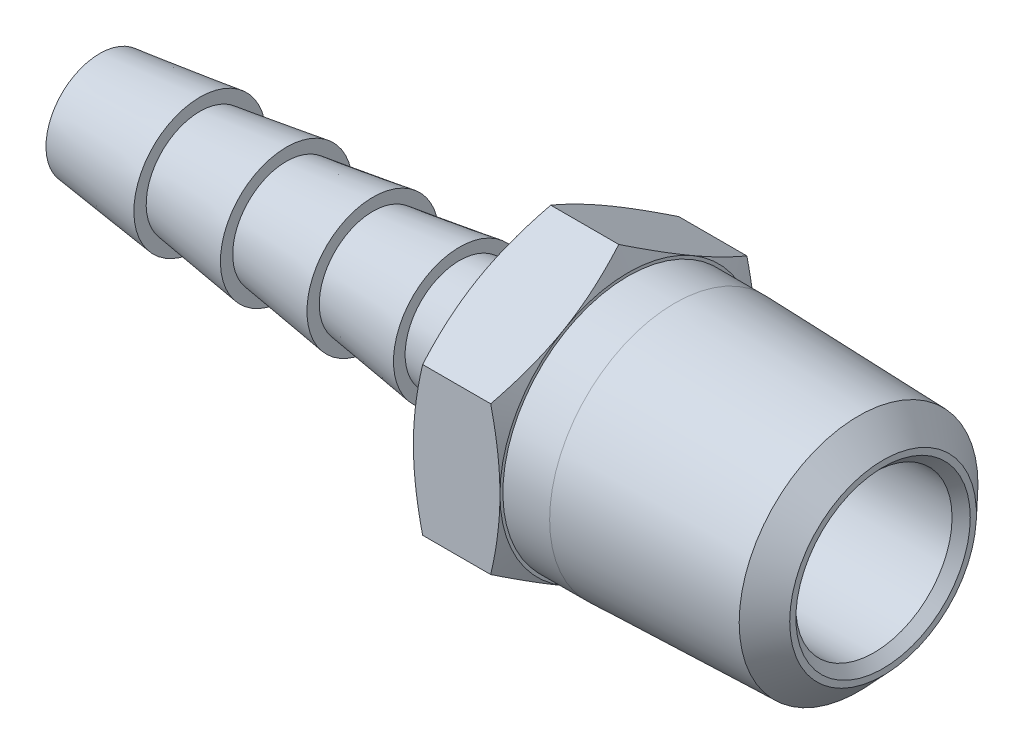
ISO-10303-21;
HEADER;
FILE_DESCRIPTION(('STEP AP214'),'2;1');
FILE_NAME('part.step','',(''),(''),'','','');
FILE_SCHEMA(('AUTOMOTIVE_DESIGN { 1 0 10303 214 1 1 1 1 }'));
ENDSEC;
DATA;
#1=APPLICATION_CONTEXT('core data for automotive mechanical design processes');
#2=APPLICATION_PROTOCOL_DEFINITION('international standard','automotive_design',2000,#1);
#3=PRODUCT_CONTEXT('',#1,'mechanical');
#4=PRODUCT('Part','Part','',(#3));
#5=PRODUCT_RELATED_PRODUCT_CATEGORY('part','',(#4));
#6=PRODUCT_DEFINITION_FORMATION('','',#4);
#7=PRODUCT_DEFINITION_CONTEXT('part definition',#1,'design');
#8=PRODUCT_DEFINITION('design','',#6,#7);
#9=PRODUCT_DEFINITION_SHAPE('','',#8);
#10=(LENGTH_UNIT() NAMED_UNIT(*) SI_UNIT(.MILLI.,.METRE.));
#11=(NAMED_UNIT(*) PLANE_ANGLE_UNIT() SI_UNIT($,.RADIAN.));
#12=(NAMED_UNIT(*) SI_UNIT($,.STERADIAN.) SOLID_ANGLE_UNIT());
#13=UNCERTAINTY_MEASURE_WITH_UNIT(LENGTH_MEASURE(1.E-05),#10,'distance_accuracy_value','');
#14=(GEOMETRIC_REPRESENTATION_CONTEXT(3) GLOBAL_UNCERTAINTY_ASSIGNED_CONTEXT((#13)) GLOBAL_UNIT_ASSIGNED_CONTEXT((#10,
#11,#12)) REPRESENTATION_CONTEXT('',''));
#15=CARTESIAN_POINT('',(0.,0.,0.));
#16=DIRECTION('',(0.,0.,1.));
#17=DIRECTION('',(1.,0.,0.));
#18=AXIS2_PLACEMENT_3D('',#15,#16,#17);
#19=CARTESIAN_POINT('',(10.414,3.3401,0.));
#20=DIRECTION('',(1.,0.,0.));
#21=DIRECTION('',(0.,0.,-1.));
#22=AXIS2_PLACEMENT_3D('',#19,#20,#21);
#23=PLANE('',#22);
#24=CARTESIAN_POINT('',(10.4139999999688,0.,0.));
#25=DIRECTION('',(1.,0.,0.));
#26=DIRECTION('',(0.,0.,-1.));
#27=AXIS2_PLACEMENT_3D('',#24,#25,#26);
#28=CIRCLE('',#27,2.9972000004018);
#29=CARTESIAN_POINT('',(10.4139999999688,0.,-2.9972000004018));
#30=VERTEX_POINT('',#29);
#31=EDGE_CURVE('E18',#30,#30,#28,.T.);
#32=ORIENTED_EDGE('',*,*,#31,.F.);
#33=EDGE_LOOP('',(#32));
#34=FACE_BOUND('',#33,.T.);
#35=CARTESIAN_POINT('',(10.4140000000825,0.,0.));
#36=DIRECTION('',(1.,0.,0.));
#37=DIRECTION('',(0.,1.,0.));
#38=AXIS2_PLACEMENT_3D('',#35,#36,#37);
#39=CIRCLE('',#38,3.68299999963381);
#40=CARTESIAN_POINT('',(10.4140000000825,3.68299999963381,0.));
#41=VERTEX_POINT('',#40);
#42=EDGE_CURVE('E458',#41,#41,#39,.F.);
#43=ORIENTED_EDGE('',*,*,#42,.F.);
#44=EDGE_LOOP('',(#43));
#45=FACE_BOUND('',#44,.T.);
#46=ADVANCED_FACE('F14',(#34,#45),#23,.T.);
#47=CARTESIAN_POINT('',(15.2400000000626,0.,0.));
#48=DIRECTION('',(1.,0.,0.));
#49=DIRECTION('',(0.,0.,-1.));
#50=AXIS2_PLACEMENT_3D('',#47,#48,#49);
#51=CONICAL_SURFACE('',#50,3.68299999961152,0.141160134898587);
#52=CARTESIAN_POINT('',(15.2400000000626,0.,0.));
#53=DIRECTION('',(1.,0.,0.));
#54=DIRECTION('',(0.,0.,-1.));
#55=AXIS2_PLACEMENT_3D('',#52,#53,#54);
#56=CIRCLE('',#55,3.68299999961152);
#57=CARTESIAN_POINT('',(15.2400000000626,0.,-3.68299999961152));
#58=VERTEX_POINT('',#57);
#59=EDGE_CURVE('E456',#58,#58,#56,.T.);
#60=ORIENTED_EDGE('',*,*,#59,.F.);
#61=EDGE_LOOP('',(#60));
#62=FACE_BOUND('',#61,.T.);
#63=ORIENTED_EDGE('',*,*,#31,.T.);
#64=EDGE_LOOP('',(#63));
#65=FACE_BOUND('',#64,.T.);
#66=ADVANCED_FACE('F465',(#62,#65),#51,.T.);
#67=CARTESIAN_POINT('',(10.4140000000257,0.,0.));
#68=DIRECTION('',(1.,0.,0.));
#69=DIRECTION('',(0.,1.,0.));
#70=AXIS2_PLACEMENT_3D('',#67,#68,#69);
#71=CONICAL_SURFACE('',#70,3.68299999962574,0.141160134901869);
#72=ORIENTED_EDGE('',*,*,#42,.T.);
#73=EDGE_LOOP('',(#72));
#74=FACE_BOUND('',#73,.T.);
#75=CARTESIAN_POINT('',(5.58799999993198,0.,0.));
#76=DIRECTION('',(1.,0.,0.));
#77=DIRECTION('',(0.,1.,0.));
#78=AXIS2_PLACEMENT_3D('',#75,#76,#77);
#79=CIRCLE('',#78,2.99720000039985);
#80=CARTESIAN_POINT('',(5.58799999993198,2.99720000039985,0.));
#81=VERTEX_POINT('',#80);
#82=EDGE_CURVE('E453',#81,#81,#79,.F.);
#83=ORIENTED_EDGE('',*,*,#82,.F.);
#84=EDGE_LOOP('',(#83));
#85=FACE_BOUND('',#84,.T.);
#86=ADVANCED_FACE('F475',(#74,#85),#71,.T.);
#87=CARTESIAN_POINT('',(15.24,3.3401,0.));
#88=DIRECTION('',(1.,0.,0.));
#89=DIRECTION('',(0.,0.,-1.));
#90=AXIS2_PLACEMENT_3D('',#87,#88,#89);
#91=PLANE('',#90);
#92=CARTESIAN_POINT('',(15.2399999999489,0.,0.));
#93=DIRECTION('',(1.,0.,0.));
#94=DIRECTION('',(0.,0.,-1.));
#95=AXIS2_PLACEMENT_3D('',#92,#93,#94);
#96=CIRCLE('',#95,2.9972000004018);
#97=CARTESIAN_POINT('',(15.2399999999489,0.,-2.9972000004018));
#98=VERTEX_POINT('',#97);
#99=EDGE_CURVE('E450',#98,#98,#96,.T.);
#100=ORIENTED_EDGE('',*,*,#99,.F.);
#101=EDGE_LOOP('',(#100));
#102=FACE_BOUND('',#101,.T.);
#103=ORIENTED_EDGE('',*,*,#59,.T.);
#104=EDGE_LOOP('',(#103));
#105=FACE_BOUND('',#104,.T.);
#106=ADVANCED_FACE('F703',(#102,#105),#91,.T.);
#107=CARTESIAN_POINT('',(5.588,3.3401,0.));
#108=DIRECTION('',(1.,0.,0.));
#109=DIRECTION('',(0.,0.,-1.));
#110=AXIS2_PLACEMENT_3D('',#107,#108,#109);
#111=PLANE('',#110);
#112=ORIENTED_EDGE('',*,*,#82,.T.);
#113=EDGE_LOOP('',(#112));
#114=FACE_BOUND('',#113,.T.);
#115=CARTESIAN_POINT('',(5.58800000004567,0.,0.));
#116=DIRECTION('',(1.,0.,0.));
#117=DIRECTION('',(0.,1.,0.));
#118=AXIS2_PLACEMENT_3D('',#115,#116,#117);
#119=CIRCLE('',#118,3.68299999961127);
#120=CARTESIAN_POINT('',(5.58800000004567,3.68299999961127,0.));
#121=VERTEX_POINT('',#120);
#122=EDGE_CURVE('E447',#121,#121,#119,.F.);
#123=ORIENTED_EDGE('',*,*,#122,.F.);
#124=EDGE_LOOP('',(#123));
#125=FACE_BOUND('',#124,.T.);
#126=ADVANCED_FACE('F695',(#114,#125),#111,.T.);
#127=CARTESIAN_POINT('',(20.0659999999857,0.,0.));
#128=DIRECTION('',(1.,0.,0.));
#129=DIRECTION('',(0.,0.,-1.));
#130=AXIS2_PLACEMENT_3D('',#127,#128,#129);
#131=CONICAL_SURFACE('',#130,3.68299999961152,0.141160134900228);
#132=CARTESIAN_POINT('',(20.0660000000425,0.,0.));
#133=DIRECTION('',(1.,0.,0.));
#134=DIRECTION('',(0.,0.,-1.));
#135=AXIS2_PLACEMENT_3D('',#132,#133,#134);
#136=CIRCLE('',#135,3.6829999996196);
#137=CARTESIAN_POINT('',(20.0660000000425,0.,-3.6829999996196));
#138=VERTEX_POINT('',#137);
#139=EDGE_CURVE('E444',#138,#138,#136,.T.);
#140=ORIENTED_EDGE('',*,*,#139,.F.);
#141=EDGE_LOOP('',(#140));
#142=FACE_BOUND('',#141,.T.);
#143=ORIENTED_EDGE('',*,*,#99,.T.);
#144=EDGE_LOOP('',(#143));
#145=FACE_BOUND('',#144,.T.);
#146=ADVANCED_FACE('F687',(#142,#145),#131,.T.);
#147=CARTESIAN_POINT('',(5.58799999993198,0.,0.));
#148=DIRECTION('',(1.,0.,0.));
#149=DIRECTION('',(0.,1.,0.));
#150=AXIS2_PLACEMENT_3D('',#147,#148,#149);
#151=CONICAL_SURFACE('',#150,3.68299999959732,0.122116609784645);
#152=ORIENTED_EDGE('',*,*,#122,.T.);
#153=EDGE_LOOP('',(#152));
#154=FACE_BOUND('',#153,.T.);
#155=CARTESIAN_POINT('',(-5.6844286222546E-11,0.,0.));
#156=DIRECTION('',(1.,0.,0.));
#157=DIRECTION('',(0.,1.,0.));
#158=AXIS2_PLACEMENT_3D('',#155,#156,#157);
#159=CIRCLE('',#158,2.99720000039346);
#160=CARTESIAN_POINT('',(-5.68449920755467E-11,2.99720000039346,0.));
#161=VERTEX_POINT('',#160);
#162=EDGE_CURVE('E441',#161,#161,#159,.F.);
#163=ORIENTED_EDGE('',*,*,#162,.F.);
#164=EDGE_LOOP('',(#163));
#165=FACE_BOUND('',#164,.T.);
#166=ADVANCED_FACE('F679',(#154,#165),#151,.T.);
#167=CARTESIAN_POINT('',(20.066,3.35814736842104,0.));
#168=DIRECTION('',(1.,0.,0.));
#169=DIRECTION('',(0.,0.,-1.));
#170=AXIS2_PLACEMENT_3D('',#167,#168,#169);
#171=PLANE('',#170);
#172=CARTESIAN_POINT('',(20.0659999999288,0.,0.));
#173=DIRECTION('',(1.,0.,0.));
#174=DIRECTION('',(0.,0.,-1.));
#175=AXIS2_PLACEMENT_3D('',#172,#173,#174);
#176=CIRCLE('',#175,3.03329473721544);
#177=CARTESIAN_POINT('',(20.0659999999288,0.,-3.03329473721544));
#178=VERTEX_POINT('',#177);
#179=EDGE_CURVE('E438',#178,#178,#176,.T.);
#180=ORIENTED_EDGE('',*,*,#179,.F.);
#181=EDGE_LOOP('',(#180));
#182=FACE_BOUND('',#181,.T.);
#183=ORIENTED_EDGE('',*,*,#139,.T.);
#184=EDGE_LOOP('',(#183));
#185=FACE_BOUND('',#184,.T.);
#186=ADVANCED_FACE('F671',(#182,#185),#171,.T.);
#187=CARTESIAN_POINT('',(0.,1.4986,0.));
#188=DIRECTION('',(-1.,0.,0.));
#189=DIRECTION('',(0.,0.,1.));
#190=AXIS2_PLACEMENT_3D('',#187,#188,#189);
#191=PLANE('',#190);
#192=CARTESIAN_POINT('',(0.,0.,0.));
#193=DIRECTION('',(1.,0.,0.));
#194=DIRECTION('',(0.,0.,-1.));
#195=AXIS2_PLACEMENT_3D('',#192,#193,#194);
#196=CIRCLE('',#195,2.3749);
#197=CARTESIAN_POINT('',(0.,0.,-2.3749));
#198=VERTEX_POINT('',#197);
#199=EDGE_CURVE('E435',#198,#198,#196,.T.);
#200=ORIENTED_EDGE('',*,*,#199,.T.);
#201=EDGE_LOOP('',(#200));
#202=FACE_BOUND('',#201,.T.);
#203=ORIENTED_EDGE('',*,*,#162,.T.);
#204=EDGE_LOOP('',(#203));
#205=FACE_BOUND('',#204,.T.);
#206=ADVANCED_FACE('F662',(#202,#205),#191,.T.);
#207=CARTESIAN_POINT('',(24.6380000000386,0.,0.));
#208=DIRECTION('',(1.,0.,0.));
#209=DIRECTION('',(0.,0.,-1.));
#210=AXIS2_PLACEMENT_3D('',#207,#208,#209);
#211=CONICAL_SURFACE('',#210,3.68299999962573,0.141160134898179);
#212=ORIENTED_EDGE('',*,*,#179,.T.);
#213=EDGE_LOOP('',(#212));
#214=FACE_BOUND('',#213,.T.);
#215=CARTESIAN_POINT('',(24.6380000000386,0.,0.));
#216=DIRECTION('',(1.,0.,0.));
#217=DIRECTION('',(0.,0.,-1.));
#218=AXIS2_PLACEMENT_3D('',#215,#216,#217);
#219=CIRCLE('',#218,3.68299999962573);
#220=CARTESIAN_POINT('',(24.6380000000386,0.,-3.68299999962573));
#221=VERTEX_POINT('',#220);
#222=EDGE_CURVE('E313',#221,#221,#219,.F.);
#223=ORIENTED_EDGE('',*,*,#222,.T.);
#224=EDGE_LOOP('',(#223));
#225=FACE_BOUND('',#224,.T.);
#226=ADVANCED_FACE('F654',(#214,#225),#211,.T.);
#227=CARTESIAN_POINT('',(48.8359588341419,0.,0.));
#228=DIRECTION('',(1.,0.,0.));
#229=DIRECTION('',(0.,0.,-1.));
#230=AXIS2_PLACEMENT_3D('',#227,#228,#229);
#231=CYLINDRICAL_SURFACE('',#230,2.3749);
#232=CARTESIAN_POINT('',(26.2415749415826,0.,0.));
#233=DIRECTION('',(1.,0.,0.));
#234=DIRECTION('',(0.,0.,-1.));
#235=AXIS2_PLACEMENT_3D('',#232,#233,#234);
#236=CIRCLE('',#235,2.3749);
#237=CARTESIAN_POINT('',(26.2415749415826,0.,-2.3749));
#238=VERTEX_POINT('',#237);
#239=EDGE_CURVE('E112',#238,#238,#236,.T.);
#240=ORIENTED_EDGE('',*,*,#239,.T.);
#241=EDGE_LOOP('',(#240));
#242=FACE_BOUND('',#241,.T.);
#243=ORIENTED_EDGE('',*,*,#199,.F.);
#244=EDGE_LOOP('',(#243));
#245=FACE_BOUND('',#244,.T.);
#246=ADVANCED_FACE('F647',(#242,#245),#231,.F.);
#247=CARTESIAN_POINT('',(24.638,0.,0.));
#248=DIRECTION('',(1.,0.,0.));
#249=DIRECTION('',(0.,0.,-1.));
#250=AXIS2_PLACEMENT_3D('',#247,#248,#249);
#251=PLANE('',#250);
#252=ORIENTED_EDGE('',*,*,#222,.F.);
#253=EDGE_LOOP('',(#252));
#254=FACE_BOUND('',#253,.T.);
#255=CARTESIAN_POINT('',(24.6379999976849,0.,0.));
#256=DIRECTION('',(1.,0.,0.));
#257=DIRECTION('',(0.,1.,0.));
#258=AXIS2_PLACEMENT_3D('',#255,#256,#257);
#259=CIRCLE('',#258,7.14375000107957);
#260=CARTESIAN_POINT('',(24.6379999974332,-6.18666897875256,3.57187500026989));
#261=VERTEX_POINT('',#260);
#262=CARTESIAN_POINT('',(24.6379999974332,-6.18666897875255,-3.57187500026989));
#263=VERTEX_POINT('',#262);
#264=EDGE_CURVE('E124',#261,#263,#259,.T.);
#265=ORIENTED_EDGE('',*,*,#264,.F.);
#266=CARTESIAN_POINT('',(24.6379999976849,0.,0.));
#267=DIRECTION('',(1.,0.,0.));
#268=DIRECTION('',(0.,0.,-1.));
#269=AXIS2_PLACEMENT_3D('',#266,#267,#268);
#270=CIRCLE('',#269,7.14375000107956);
#271=CARTESIAN_POINT('',(24.6379999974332,0.,7.14375000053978));
#272=VERTEX_POINT('',#271);
#273=EDGE_CURVE('E426',#272,#261,#270,.T.);
#274=ORIENTED_EDGE('',*,*,#273,.F.);
#275=CARTESIAN_POINT('',(24.6379999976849,0.,0.));
#276=DIRECTION('',(1.,0.,0.));
#277=DIRECTION('',(0.,0.,-1.));
#278=AXIS2_PLACEMENT_3D('',#275,#276,#277);
#279=CIRCLE('',#278,7.14375000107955);
#280=CARTESIAN_POINT('',(24.6379999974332,6.18666897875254,3.57187500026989));
#281=VERTEX_POINT('',#280);
#282=EDGE_CURVE('E427',#281,#272,#279,.T.);
#283=ORIENTED_EDGE('',*,*,#282,.F.);
#284=CARTESIAN_POINT('',(24.6379999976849,0.,0.));
#285=DIRECTION('',(1.,0.,0.));
#286=DIRECTION('',(0.,1.,0.));
#287=AXIS2_PLACEMENT_3D('',#284,#285,#286);
#288=CIRCLE('',#287,7.14375000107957);
#289=CARTESIAN_POINT('',(24.6379999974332,6.18666897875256,-3.57187500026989));
#290=VERTEX_POINT('',#289);
#291=EDGE_CURVE('E107',#290,#281,#288,.T.);
#292=ORIENTED_EDGE('',*,*,#291,.F.);
#293=CARTESIAN_POINT('',(24.6379999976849,0.,0.));
#294=DIRECTION('',(1.,0.,0.));
#295=DIRECTION('',(0.,0.,-1.));
#296=AXIS2_PLACEMENT_3D('',#293,#294,#295);
#297=CIRCLE('',#296,7.14375000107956);
#298=CARTESIAN_POINT('',(24.6379999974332,0.,-7.14375000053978));
#299=VERTEX_POINT('',#298);
#300=EDGE_CURVE('E101',#299,#290,#297,.T.);
#301=ORIENTED_EDGE('',*,*,#300,.F.);
#302=CARTESIAN_POINT('',(24.6379999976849,0.,0.));
#303=DIRECTION('',(1.,0.,0.));
#304=DIRECTION('',(0.,1.,0.));
#305=AXIS2_PLACEMENT_3D('',#302,#303,#304);
#306=CIRCLE('',#305,7.14375000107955);
#307=EDGE_CURVE('E104',#263,#299,#306,.T.);
#308=ORIENTED_EDGE('',*,*,#307,.F.);
#309=EDGE_LOOP('',(#265,#274,#283,#292,#301,#308));
#310=FACE_BOUND('',#309,.T.);
#311=ADVANCED_FACE('F103',(#254,#310),#251,.F.);
#312=CARTESIAN_POINT('',(27.432,0.,0.));
#313=DIRECTION('',(1.,0.,0.));
#314=DIRECTION('',(0.,0.,-1.));
#315=AXIS2_PLACEMENT_3D('',#312,#313,#314);
#316=CONICAL_SURFACE('',#315,4.3561,1.02974425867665);
#317=CARTESIAN_POINT('',(27.432,0.,0.));
#318=DIRECTION('',(1.,0.,0.));
#319=DIRECTION('',(0.,0.,-1.));
#320=AXIS2_PLACEMENT_3D('',#317,#318,#319);
#321=CIRCLE('',#320,4.3561);
#322=CARTESIAN_POINT('',(27.432,0.,-4.3561));
#323=VERTEX_POINT('',#322);
#324=EDGE_CURVE('E123',#323,#323,#321,.T.);
#325=ORIENTED_EDGE('',*,*,#324,.T.);
#326=EDGE_LOOP('',(#325));
#327=FACE_BOUND('',#326,.T.);
#328=ORIENTED_EDGE('',*,*,#239,.F.);
#329=EDGE_LOOP('',(#328));
#330=FACE_BOUND('',#329,.T.);
#331=ADVANCED_FACE('F635',(#327,#330),#316,.F.);
#332=CARTESIAN_POINT('',(25.1564281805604,0.,0.));
#333=DIRECTION('',(1.,0.,0.));
#334=DIRECTION('',(0.,0.,-1.));
#335=AXIS2_PLACEMENT_3D('',#332,#333,#334);
#336=CONICAL_SURFACE('',#335,8.25552282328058,1.1344640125);
#337=CARTESIAN_POINT('',(24.6379999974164,0.,-7.14374999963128));
#338=CARTESIAN_POINT('',(24.6379793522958,0.173952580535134,-7.14374999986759));
#339=CARTESIAN_POINT('',(24.6409623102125,0.347900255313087,-7.14374999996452));
#340=CARTESIAN_POINT('',(24.6527826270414,0.695577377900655,-7.14375000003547));
#341=CARTESIAN_POINT('',(24.6616193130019,0.869306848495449,-7.14375000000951));
#342=CARTESIAN_POINT('',(24.6849554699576,1.21580198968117,-7.14374999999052));
#343=CARTESIAN_POINT('',(24.6994360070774,1.38856894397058,-7.14374999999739));
#344=CARTESIAN_POINT('',(24.7337794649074,1.73356525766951,-7.14375000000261));
#345=CARTESIAN_POINT('',(24.7536424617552,1.90579460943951,-7.14375000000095));
#346=CARTESIAN_POINT('',(24.8207679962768,2.42120612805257,-7.14374999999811));
#347=CARTESIAN_POINT('',(24.8755879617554,2.76340602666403,-7.14374999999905));
#348=CARTESIAN_POINT('',(25.0023800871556,3.44583405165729,-7.14375000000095));
#349=CARTESIAN_POINT('',(25.0744094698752,3.78605163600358,-7.14375000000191));
#350=CARTESIAN_POINT('',(25.1533361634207,4.12444598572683,-7.14375));
#351=B_SPLINE_CURVE_WITH_KNOTS('',3,(#337,#338,#339,#340,#341,#342,#343,#344,#345,#346,#347,
#348,#349,#350),.UNSPECIFIED.,.F.,.F.,(4,2,2,2,2,2,4),(0.,0.521824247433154,1.04358851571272,
1.5636172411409,2.08365332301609,3.1228420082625,4.16553539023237),.UNSPECIFIED.);
#352=CARTESIAN_POINT('',(25.1533361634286,4.1244459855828,-7.14375000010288));
#353=VERTEX_POINT('',#352);
#354=EDGE_CURVE('E126',#299,#353,#351,.T.);
#355=ORIENTED_EDGE('',*,*,#354,.F.);
#356=ORIENTED_EDGE('',*,*,#300,.T.);
#357=CARTESIAN_POINT('',(25.1533361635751,4.12444598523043,-7.14375000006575));
#358=CARTESIAN_POINT('',(25.0744094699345,4.29364316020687,-6.85069189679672));
#359=CARTESIAN_POINT('',(25.0023800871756,4.46375195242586,-6.55605482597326));
#360=CARTESIAN_POINT('',(24.8755879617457,4.80496596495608,-5.96505482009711));
#361=CARTESIAN_POINT('',(24.8207679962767,4.97606591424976,-5.66870101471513));
#362=CARTESIAN_POINT('',(24.7536424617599,5.23377167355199,-5.22234154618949));
#363=CARTESIAN_POINT('',(24.7337794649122,5.3198863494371,-5.07318655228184));
#364=CARTESIAN_POINT('',(24.699436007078,5.49238450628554,-4.77441098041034));
#365=CARTESIAN_POINT('',(24.6849554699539,5.57876798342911,-4.62479040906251));
#366=CARTESIAN_POINT('',(24.6616193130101,5.75201555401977,-4.32471681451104));
#367=CARTESIAN_POINT('',(24.6527826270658,5.83888028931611,-4.1742626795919));
#368=CARTESIAN_POINT('',(24.6409623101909,6.01271885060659,-3.87316545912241));
#369=CARTESIAN_POINT('',(24.6379793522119,6.09969268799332,-3.7225223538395));
#370=CARTESIAN_POINT('',(24.6379999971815,6.18666897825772,-3.57187500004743));
#371=B_SPLINE_CURVE_WITH_KNOTS('',3,(#357,#358,#359,#360,#361,#362,#363,#364,#365,#366,#367,
#368,#369,#370),.UNSPECIFIED.,.F.,.F.,(4,2,2,2,2,2,4),(0.,1.04269338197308,2.08188206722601,
2.60191814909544,3.12194687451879,3.64371114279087,4.16553539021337),.UNSPECIFIED.);
#372=EDGE_CURVE('E129',#353,#290,#371,.T.);
#373=ORIENTED_EDGE('',*,*,#372,.F.);
#374=EDGE_LOOP('',(#355,#356,#373));
#375=FACE_BOUND('',#374,.T.);
#376=ADVANCED_FACE('F127',(#375),#336,.T.);
#377=CARTESIAN_POINT('',(25.1564281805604,0.,0.));
#378=DIRECTION('',(1.,0.,0.));
#379=DIRECTION('',(0.,1.,0.));
#380=AXIS2_PLACEMENT_3D('',#377,#378,#379);
#381=CONICAL_SURFACE('',#380,8.25552282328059,1.1344640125);
#382=CARTESIAN_POINT('',(24.6379999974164,6.18666897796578,-3.57187499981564));
#383=CARTESIAN_POINT('',(24.6379793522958,6.27364526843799,-3.42122764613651));
#384=CARTESIAN_POINT('',(24.6409623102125,6.36061910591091,-3.27058454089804));
#385=CARTESIAN_POINT('',(24.6527826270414,6.53445766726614,-2.96948732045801));
#386=CARTESIAN_POINT('',(24.6616193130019,6.62132240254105,-2.81903318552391));
#387=CARTESIAN_POINT('',(24.6849554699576,6.79456997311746,-2.51895959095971));
#388=CARTESIAN_POINT('',(24.6994360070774,6.88095345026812,-2.36933901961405));
#389=CARTESIAN_POINT('',(24.7337794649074,7.0534516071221,-2.0705634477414));
#390=CARTESIAN_POINT('',(24.7536424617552,7.13956628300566,-1.92140845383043));
#391=CARTESIAN_POINT('',(24.8207679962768,7.39727204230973,-1.47504898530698));
#392=CARTESIAN_POINT('',(24.8755879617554,7.56837199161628,-1.17869517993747));
#393=CARTESIAN_POINT('',(25.0023800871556,7.90958600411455,-0.58769517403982));
#394=CARTESIAN_POINT('',(25.0744094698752,8.07969479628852,-0.293058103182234));
#395=CARTESIAN_POINT('',(25.1533361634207,8.2488919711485,1.76170662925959E-10));
#396=B_SPLINE_CURVE_WITH_KNOTS('',3,(#382,#383,#384,#385,#386,#387,#388,#389,#390,#391,#392,
#393,#394,#395),.UNSPECIFIED.,.F.,.F.,(4,2,2,2,2,2,4),(0.,0.521824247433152,1.04358851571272,
1.56361724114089,2.08365332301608,3.12284200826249,4.16553539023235),.UNSPECIFIED.);
#397=CARTESIAN_POINT('',(25.1533361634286,8.24889197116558,0.));
#398=VERTEX_POINT('',#397);
#399=EDGE_CURVE('E294',#290,#398,#396,.T.);
#400=ORIENTED_EDGE('',*,*,#399,.F.);
#401=ORIENTED_EDGE('',*,*,#291,.T.);
#402=CARTESIAN_POINT('',(25.1533361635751,8.24889197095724,-2.865945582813E-10));
#403=CARTESIAN_POINT('',(25.0744094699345,8.07969479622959,0.293058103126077));
#404=CARTESIAN_POINT('',(25.0023800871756,7.90958600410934,0.587695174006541));
#405=CARTESIAN_POINT('',(24.8755879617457,7.56837199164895,1.17869517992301));
#406=CARTESIAN_POINT('',(24.8207679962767,7.3972720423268,1.47504898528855));
#407=CARTESIAN_POINT('',(24.7536424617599,7.13956628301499,1.92140845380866));
#408=CARTESIAN_POINT('',(24.7337794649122,7.05345160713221,2.07056344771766));
#409=CARTESIAN_POINT('',(24.699436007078,6.88095345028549,2.36933901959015));
#410=CARTESIAN_POINT('',(24.6849554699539,6.79456997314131,2.51895959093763));
#411=CARTESIAN_POINT('',(24.6616193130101,6.62132240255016,2.81903318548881));
#412=CARTESIAN_POINT('',(24.6527826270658,6.53445766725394,2.96948732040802));
#413=CARTESIAN_POINT('',(24.6409623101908,6.36061910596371,3.27058454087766));
#414=CARTESIAN_POINT('',(24.6379793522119,6.27364526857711,3.42122764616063));
#415=CARTESIAN_POINT('',(24.6379999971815,6.18666897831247,3.57187499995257));
#416=B_SPLINE_CURVE_WITH_KNOTS('',3,(#402,#403,#404,#405,#406,#407,#408,#409,#410,#411,#412,
#413,#414,#415),.UNSPECIFIED.,.F.,.F.,(4,2,2,2,2,2,4),(0.,1.04269338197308,2.08188206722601,
2.60191814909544,3.12194687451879,3.64371114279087,4.16553539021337),.UNSPECIFIED.);
#417=EDGE_CURVE('E269',#398,#281,#416,.T.);
#418=ORIENTED_EDGE('',*,*,#417,.F.);
#419=EDGE_LOOP('',(#400,#401,#418));
#420=FACE_BOUND('',#419,.T.);
#421=ADVANCED_FACE('F284',(#420),#381,.T.);
#422=CARTESIAN_POINT('',(25.1564281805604,0.,0.));
#423=DIRECTION('',(1.,0.,0.));
#424=DIRECTION('',(0.,0.,-1.));
#425=AXIS2_PLACEMENT_3D('',#422,#423,#424);
#426=CONICAL_SURFACE('',#425,8.25552282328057,1.1344640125);
#427=CARTESIAN_POINT('',(24.6379999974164,6.18666897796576,3.57187499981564));
#428=CARTESIAN_POINT('',(24.6379793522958,6.09969268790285,3.72252235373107));
#429=CARTESIAN_POINT('',(24.6409623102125,6.01271885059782,3.87316545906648));
#430=CARTESIAN_POINT('',(24.6527826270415,5.83888028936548,4.17426267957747));
#431=CARTESIAN_POINT('',(24.6616193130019,5.75201555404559,4.3247168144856));
#432=CARTESIAN_POINT('',(24.6849554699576,5.5787679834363,4.62479040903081));
#433=CARTESIAN_POINT('',(24.6994360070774,5.49238450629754,4.77441098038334));
#434=CARTESIAN_POINT('',(24.7337794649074,5.31988634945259,5.0731865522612));
#435=CARTESIAN_POINT('',(24.7536424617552,5.23377167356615,5.22234154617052));
#436=CARTESIAN_POINT('',(24.8207679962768,4.97606591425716,5.66870101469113));
#437=CARTESIAN_POINT('',(24.8755879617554,4.80496596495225,5.96505482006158));
#438=CARTESIAN_POINT('',(25.0023800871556,4.46375195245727,6.55605482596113));
#439=CARTESIAN_POINT('',(25.0744094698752,4.29364316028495,6.85069189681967));
#440=CARTESIAN_POINT('',(25.1533361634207,4.12444598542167,7.14375000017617));
#441=B_SPLINE_CURVE_WITH_KNOTS('',3,(#427,#428,#429,#430,#431,#432,#433,#434,#435,#436,#437,
#438,#439,#440),.UNSPECIFIED.,.F.,.F.,(4,2,2,2,2,2,4),(0.,0.521824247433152,1.04358851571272,
1.56361724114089,2.08365332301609,3.12284200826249,4.16553539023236),.UNSPECIFIED.);
#442=CARTESIAN_POINT('',(25.1533361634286,4.12444598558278,7.14375000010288));
#443=VERTEX_POINT('',#442);
#444=EDGE_CURVE('E262',#281,#443,#441,.T.);
#445=ORIENTED_EDGE('',*,*,#444,.F.);
#446=ORIENTED_EDGE('',*,*,#282,.T.);
#447=CARTESIAN_POINT('',(25.1533361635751,4.12444598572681,7.14374999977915));
#448=CARTESIAN_POINT('',(25.0744094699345,3.78605163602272,7.14374999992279));
#449=CARTESIAN_POINT('',(25.0023800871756,3.44583405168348,7.1437499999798));
#450=CARTESIAN_POINT('',(24.8755879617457,2.76340602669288,7.14375000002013));
#451=CARTESIAN_POINT('',(24.8207679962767,2.42120612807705,7.14375000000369));
#452=CARTESIAN_POINT('',(24.7536424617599,1.90579460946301,7.14374999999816));
#453=CARTESIAN_POINT('',(24.7337794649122,1.73356525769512,7.1437499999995));
#454=CARTESIAN_POINT('',(24.699436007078,1.38856894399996,7.1437500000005));
#455=CARTESIAN_POINT('',(24.6849554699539,1.21580198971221,7.14375000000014));
#456=CARTESIAN_POINT('',(24.6616193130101,0.869306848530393,7.14374999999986));
#457=CARTESIAN_POINT('',(24.6527826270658,0.695577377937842,7.14374999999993));
#458=CARTESIAN_POINT('',(24.6409623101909,0.347900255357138,7.14375000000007));
#459=CARTESIAN_POINT('',(24.637979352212,0.173952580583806,7.14375000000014));
#460=CARTESIAN_POINT('',(24.6379999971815,5.47689358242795E-11,7.14375));
#461=B_SPLINE_CURVE_WITH_KNOTS('',3,(#447,#448,#449,#450,#451,#452,#453,#454,#455,#456,#457,
#458,#459,#460),.UNSPECIFIED.,.F.,.F.,(4,2,2,2,2,2,4),(0.,1.04269338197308,2.081882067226,
2.60191814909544,3.12194687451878,3.64371114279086,4.16553539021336),.UNSPECIFIED.);
#462=EDGE_CURVE('E270',#443,#272,#461,.T.);
#463=ORIENTED_EDGE('',*,*,#462,.F.);
#464=EDGE_LOOP('',(#445,#446,#463));
#465=FACE_BOUND('',#464,.T.);
#466=ADVANCED_FACE('F280',(#465),#426,.T.);
#467=CARTESIAN_POINT('',(25.1564281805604,0.,0.));
#468=DIRECTION('',(1.,0.,0.));
#469=DIRECTION('',(0.,0.,-1.));
#470=AXIS2_PLACEMENT_3D('',#467,#468,#469);
#471=CONICAL_SURFACE('',#470,8.25552282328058,1.1344640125);
#472=ORIENTED_EDGE('',*,*,#273,.T.);
#473=CARTESIAN_POINT('',(25.1533361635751,-4.12444598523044,7.14375000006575));
#474=CARTESIAN_POINT('',(25.0744094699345,-4.29364316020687,6.85069189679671));
#475=CARTESIAN_POINT('',(25.0023800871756,-4.46375195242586,6.55605482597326));
#476=CARTESIAN_POINT('',(24.8755879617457,-4.80496596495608,5.96505482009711));
#477=CARTESIAN_POINT('',(24.8207679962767,-4.97606591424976,5.66870101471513));
#478=CARTESIAN_POINT('',(24.7536424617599,-5.23377167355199,5.22234154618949));
#479=CARTESIAN_POINT('',(24.7337794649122,-5.3198863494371,5.07318655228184));
#480=CARTESIAN_POINT('',(24.699436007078,-5.49238450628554,4.77441098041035));
#481=CARTESIAN_POINT('',(24.6849554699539,-5.57876798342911,4.62479040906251));
#482=CARTESIAN_POINT('',(24.6616193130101,-5.75201555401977,4.32471681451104));
#483=CARTESIAN_POINT('',(24.6527826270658,-5.8388802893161,4.17426267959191));
#484=CARTESIAN_POINT('',(24.6409623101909,-6.01271885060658,3.87316545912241));
#485=CARTESIAN_POINT('',(24.6379793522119,-6.09969268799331,3.72252235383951));
#486=CARTESIAN_POINT('',(24.6379999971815,-6.18666897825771,3.57187500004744));
#487=B_SPLINE_CURVE_WITH_KNOTS('',3,(#473,#474,#475,#476,#477,#478,#479,#480,#481,#482,#483,
#484,#485,#486),.UNSPECIFIED.,.F.,.F.,(4,2,2,2,2,2,4),(0.,1.04269338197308,2.081882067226,
2.60191814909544,3.12194687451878,3.64371114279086,4.16553539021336),.UNSPECIFIED.);
#488=CARTESIAN_POINT('',(25.1533361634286,-4.12444598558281,7.14375000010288));
#489=VERTEX_POINT('',#488);
#490=EDGE_CURVE('E403',#489,#261,#487,.T.);
#491=ORIENTED_EDGE('',*,*,#490,.F.);
#492=CARTESIAN_POINT('',(24.6379999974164,0.,7.14374999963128));
#493=CARTESIAN_POINT('',(24.6379793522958,-0.173952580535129,7.14374999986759));
#494=CARTESIAN_POINT('',(24.6409623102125,-0.347900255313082,7.14374999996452));
#495=CARTESIAN_POINT('',(24.6527826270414,-0.695577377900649,7.14375000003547));
#496=CARTESIAN_POINT('',(24.6616193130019,-0.869306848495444,7.14375000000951));
#497=CARTESIAN_POINT('',(24.6849554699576,-1.21580198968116,7.14374999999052));
#498=CARTESIAN_POINT('',(24.6994360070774,-1.38856894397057,7.14374999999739));
#499=CARTESIAN_POINT('',(24.7337794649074,-1.7335652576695,7.14375000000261));
#500=CARTESIAN_POINT('',(24.7536424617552,-1.9057946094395,7.14375000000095));
#501=CARTESIAN_POINT('',(24.8207679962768,-2.42120612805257,7.14374999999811));
#502=CARTESIAN_POINT('',(24.8755879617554,-2.76340602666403,7.14374999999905));
#503=CARTESIAN_POINT('',(25.0023800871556,-3.44583405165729,7.14375000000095));
#504=CARTESIAN_POINT('',(25.0744094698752,-3.78605163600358,7.14375000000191));
#505=CARTESIAN_POINT('',(25.1533361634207,-4.12444598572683,7.14375));
#506=B_SPLINE_CURVE_WITH_KNOTS('',3,(#492,#493,#494,#495,#496,#497,#498,#499,#500,#501,#502,
#503,#504,#505),.UNSPECIFIED.,.F.,.F.,(4,2,2,2,2,2,4),(0.,0.521824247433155,1.04358851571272,
1.5636172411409,2.0836533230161,3.12284200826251,4.16553539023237),.UNSPECIFIED.);
#507=EDGE_CURVE('E404',#272,#489,#506,.T.);
#508=ORIENTED_EDGE('',*,*,#507,.F.);
#509=EDGE_LOOP('',(#472,#491,#508));
#510=FACE_BOUND('',#509,.T.);
#511=ADVANCED_FACE('F283',(#510),#471,.T.);
#512=CARTESIAN_POINT('',(25.1564281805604,0.,0.));
#513=DIRECTION('',(1.,0.,0.));
#514=DIRECTION('',(0.,1.,0.));
#515=AXIS2_PLACEMENT_3D('',#512,#513,#514);
#516=CONICAL_SURFACE('',#515,8.25552282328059,1.1344640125);
#517=ORIENTED_EDGE('',*,*,#264,.T.);
#518=CARTESIAN_POINT('',(25.1533361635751,-8.24889197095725,2.865769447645E-10));
#519=CARTESIAN_POINT('',(25.0744094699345,-8.07969479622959,-0.293058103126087));
#520=CARTESIAN_POINT('',(25.0023800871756,-7.90958600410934,-0.587695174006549));
#521=CARTESIAN_POINT('',(24.8755879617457,-7.56837199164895,-1.17869517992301));
#522=CARTESIAN_POINT('',(24.8207679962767,-7.3972720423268,-1.47504898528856));
#523=CARTESIAN_POINT('',(24.7536424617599,-7.13956628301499,-1.92140845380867));
#524=CARTESIAN_POINT('',(24.7337794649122,-7.05345160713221,-2.07056344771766));
#525=CARTESIAN_POINT('',(24.699436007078,-6.88095345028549,-2.36933901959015));
#526=CARTESIAN_POINT('',(24.6849554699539,-6.79456997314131,-2.51895959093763));
#527=CARTESIAN_POINT('',(24.6616193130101,-6.62132240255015,-2.81903318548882));
#528=CARTESIAN_POINT('',(24.6527826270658,-6.53445766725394,-2.96948732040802));
#529=CARTESIAN_POINT('',(24.6409623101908,-6.36061910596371,-3.27058454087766));
#530=CARTESIAN_POINT('',(24.6379793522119,-6.27364526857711,-3.42122764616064));
#531=CARTESIAN_POINT('',(24.6379999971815,-6.18666897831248,-3.57187499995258));
#532=B_SPLINE_CURVE_WITH_KNOTS('',3,(#518,#519,#520,#521,#522,#523,#524,#525,#526,#527,#528,
#529,#530,#531),.UNSPECIFIED.,.F.,.F.,(4,2,2,2,2,2,4),(0.,1.04269338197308,2.08188206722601,
2.60191814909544,3.12194687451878,3.64371114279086,4.16553539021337),.UNSPECIFIED.);
#533=CARTESIAN_POINT('',(25.1533361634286,-8.24889197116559,0.));
#534=VERTEX_POINT('',#533);
#535=EDGE_CURVE('E167',#534,#263,#532,.T.);
#536=ORIENTED_EDGE('',*,*,#535,.F.);
#537=CARTESIAN_POINT('',(24.6379999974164,-6.18666897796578,3.57187499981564));
#538=CARTESIAN_POINT('',(24.6379793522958,-6.27364526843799,3.42122764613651));
#539=CARTESIAN_POINT('',(24.6409623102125,-6.36061910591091,3.27058454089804));
#540=CARTESIAN_POINT('',(24.6527826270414,-6.53445766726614,2.969487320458));
#541=CARTESIAN_POINT('',(24.6616193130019,-6.62132240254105,2.8190331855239));
#542=CARTESIAN_POINT('',(24.6849554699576,-6.79456997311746,2.51895959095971));
#543=CARTESIAN_POINT('',(24.6994360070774,-6.88095345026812,2.36933901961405));
#544=CARTESIAN_POINT('',(24.7337794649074,-7.0534516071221,2.0705634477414));
#545=CARTESIAN_POINT('',(24.7536424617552,-7.13956628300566,1.92140845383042));
#546=CARTESIAN_POINT('',(24.8207679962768,-7.39727204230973,1.47504898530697));
#547=CARTESIAN_POINT('',(24.8755879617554,-7.56837199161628,1.17869517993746));
#548=CARTESIAN_POINT('',(25.0023800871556,-7.90958600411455,0.587695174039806));
#549=CARTESIAN_POINT('',(25.0744094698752,-8.07969479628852,0.293058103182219));
#550=CARTESIAN_POINT('',(25.1533361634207,-8.2488919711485,-1.76188386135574E-10));
#551=B_SPLINE_CURVE_WITH_KNOTS('',3,(#537,#538,#539,#540,#541,#542,#543,#544,#545,#546,#547,
#548,#549,#550),.UNSPECIFIED.,.F.,.F.,(4,2,2,2,2,2,4),(0.,0.521824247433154,1.04358851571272,
1.5636172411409,2.08365332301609,3.1228420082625,4.16553539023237),.UNSPECIFIED.);
#552=EDGE_CURVE('E400',#261,#534,#551,.T.);
#553=ORIENTED_EDGE('',*,*,#552,.F.);
#554=EDGE_LOOP('',(#517,#536,#553));
#555=FACE_BOUND('',#554,.T.);
#556=ADVANCED_FACE('F156',(#555),#516,.T.);
#557=CARTESIAN_POINT('',(25.1564281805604,0.,0.));
#558=DIRECTION('',(1.,0.,0.));
#559=DIRECTION('',(0.,1.,0.));
#560=AXIS2_PLACEMENT_3D('',#557,#558,#559);
#561=CONICAL_SURFACE('',#560,8.25552282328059,1.1344640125);
#562=ORIENTED_EDGE('',*,*,#307,.T.);
#563=CARTESIAN_POINT('',(25.1533361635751,-4.12444598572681,-7.14374999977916));
#564=CARTESIAN_POINT('',(25.0744094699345,-3.78605163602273,-7.1437499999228));
#565=CARTESIAN_POINT('',(25.0023800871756,-3.44583405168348,-7.14374999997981));
#566=CARTESIAN_POINT('',(24.8755879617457,-2.76340602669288,-7.14375000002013));
#567=CARTESIAN_POINT('',(24.8207679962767,-2.42120612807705,-7.14375000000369));
#568=CARTESIAN_POINT('',(24.7536424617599,-1.90579460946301,-7.14374999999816));
#569=CARTESIAN_POINT('',(24.7337794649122,-1.73356525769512,-7.1437499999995));
#570=CARTESIAN_POINT('',(24.699436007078,-1.38856894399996,-7.1437500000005));
#571=CARTESIAN_POINT('',(24.6849554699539,-1.21580198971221,-7.14375000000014));
#572=CARTESIAN_POINT('',(24.6616193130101,-0.86930684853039,-7.14374999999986));
#573=CARTESIAN_POINT('',(24.6527826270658,-0.695577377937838,-7.14374999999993));
#574=CARTESIAN_POINT('',(24.6409623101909,-0.347900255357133,-7.14375000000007));
#575=CARTESIAN_POINT('',(24.6379793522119,-0.1739525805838,-7.14375000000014));
#576=CARTESIAN_POINT('',(24.6379999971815,-5.47623995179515E-11,-7.14375));
#577=B_SPLINE_CURVE_WITH_KNOTS('',3,(#563,#564,#565,#566,#567,#568,#569,#570,#571,#572,#573,
#574,#575,#576),.UNSPECIFIED.,.F.,.F.,(4,2,2,2,2,2,4),(0.,1.04269338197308,2.08188206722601,
2.60191814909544,3.12194687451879,3.64371114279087,4.16553539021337),.UNSPECIFIED.);
#578=CARTESIAN_POINT('',(25.1533361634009,-4.12444598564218,-7.14375));
#579=VERTEX_POINT('',#578);
#580=EDGE_CURVE('E118',#579,#299,#577,.T.);
#581=ORIENTED_EDGE('',*,*,#580,.F.);
#582=CARTESIAN_POINT('',(24.6379999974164,-6.18666897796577,-3.57187499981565));
#583=CARTESIAN_POINT('',(24.6379793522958,-6.09969268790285,-3.72252235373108));
#584=CARTESIAN_POINT('',(24.6409623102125,-6.01271885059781,-3.87316545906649));
#585=CARTESIAN_POINT('',(24.6527826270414,-5.83888028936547,-4.17426267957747));
#586=CARTESIAN_POINT('',(24.6616193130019,-5.75201555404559,-4.3247168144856));
#587=CARTESIAN_POINT('',(24.6849554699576,-5.57876798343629,-4.62479040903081));
#588=CARTESIAN_POINT('',(24.6994360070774,-5.49238450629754,-4.77441098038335));
#589=CARTESIAN_POINT('',(24.7337794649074,-5.31988634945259,-5.07318655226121));
#590=CARTESIAN_POINT('',(24.7536424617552,-5.23377167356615,-5.22234154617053));
#591=CARTESIAN_POINT('',(24.8207679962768,-4.97606591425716,-5.66870101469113));
#592=CARTESIAN_POINT('',(24.8755879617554,-4.80496596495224,-5.96505482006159));
#593=CARTESIAN_POINT('',(25.0023800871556,-4.46375195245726,-6.55605482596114));
#594=CARTESIAN_POINT('',(25.0744094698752,-4.29364316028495,-6.85069189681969));
#595=CARTESIAN_POINT('',(25.1533361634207,-4.12444598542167,-7.14375000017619));
#596=B_SPLINE_CURVE_WITH_KNOTS('',3,(#582,#583,#584,#585,#586,#587,#588,#589,#590,#591,#592,
#593,#594,#595),.UNSPECIFIED.,.F.,.F.,(4,2,2,2,2,2,4),(0.,0.521824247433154,1.04358851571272,
1.5636172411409,2.08365332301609,3.1228420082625,4.16553539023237),.UNSPECIFIED.);
#597=EDGE_CURVE('E121',#263,#579,#596,.T.);
#598=ORIENTED_EDGE('',*,*,#597,.F.);
#599=EDGE_LOOP('',(#562,#581,#598));
#600=FACE_BOUND('',#599,.T.);
#601=ADVANCED_FACE('F116',(#600),#561,.T.);
#602=CARTESIAN_POINT('',(43.18,0.,0.));
#603=DIRECTION('',(-1.,0.,0.));
#604=DIRECTION('',(0.,0.,1.));
#605=AXIS2_PLACEMENT_3D('',#602,#603,#604);
#606=CYLINDRICAL_SURFACE('',#605,4.3561);
#607=CARTESIAN_POINT('',(43.1799999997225,0.,0.));
#608=DIRECTION('',(1.,0.,0.));
#609=DIRECTION('',(0.,-1.,0.));
#610=AXIS2_PLACEMENT_3D('',#607,#608,#609);
#611=CIRCLE('',#610,4.35610000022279);
#612=CARTESIAN_POINT('',(43.1799999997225,-4.35610000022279,0.));
#613=VERTEX_POINT('',#612);
#614=EDGE_CURVE('E308',#613,#613,#611,.T.);
#615=ORIENTED_EDGE('',*,*,#614,.T.);
#616=EDGE_LOOP('',(#615));
#617=FACE_BOUND('',#616,.T.);
#618=ORIENTED_EDGE('',*,*,#324,.F.);
#619=EDGE_LOOP('',(#618));
#620=FACE_BOUND('',#619,.T.);
#621=ADVANCED_FACE('F16',(#617,#620),#606,.F.);
#622=CARTESIAN_POINT('',(24.638,4.12444598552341,-7.14375));
#623=DIRECTION('',(0.,0.,-1.));
#624=DIRECTION('',(-1.,0.,0.));
#625=AXIS2_PLACEMENT_3D('',#622,#623,#624);
#626=PLANE('',#625);
#627=ORIENTED_EDGE('',*,*,#354,.T.);
#628=DIRECTION('',(1.,0.,0.));
#629=VECTOR('',#628,1.);
#630=CARTESIAN_POINT('',(24.638,4.12444598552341,-7.14375));
#631=LINE('',#630,#629);
#632=CARTESIAN_POINT('',(28.9486638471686,4.12444600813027,-7.14374996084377));
#633=VERTEX_POINT('',#632);
#634=EDGE_CURVE('E132',#633,#353,#631,.F.);
#635=ORIENTED_EDGE('',*,*,#634,.F.);
#636=CARTESIAN_POINT('',(29.4640000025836,0.,-7.14374999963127));
#637=CARTESIAN_POINT('',(29.464020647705,0.173952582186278,-7.14374999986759));
#638=CARTESIAN_POINT('',(29.4610376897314,0.347900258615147,-7.14374999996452));
#639=CARTESIAN_POINT('',(29.4492173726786,0.695577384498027,-7.14375000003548));
#640=CARTESIAN_POINT('',(29.4403806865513,0.869306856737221,-7.14375000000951));
#641=CARTESIAN_POINT('',(29.4170445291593,1.21580200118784,-7.14374999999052));
#642=CARTESIAN_POINT('',(29.4025639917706,1.38856895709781,-7.14374999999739));
#643=CARTESIAN_POINT('',(29.3682205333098,1.73356527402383,-7.14375000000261));
#644=CARTESIAN_POINT('',(29.3483575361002,1.90579462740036,-7.14375000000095));
#645=CARTESIAN_POINT('',(29.2812320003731,2.42120615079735,-7.14374999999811));
#646=CARTESIAN_POINT('',(29.2264120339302,2.76340605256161,-7.14374999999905));
#647=CARTESIAN_POINT('',(29.0996199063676,3.44583408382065,-7.14375000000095));
#648=CARTESIAN_POINT('',(29.0275905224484,3.78605167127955,-7.14375000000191));
#649=CARTESIAN_POINT('',(28.9486638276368,4.12444602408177,-7.14375));
#650=B_SPLINE_CURVE_WITH_KNOTS('',3,(#636,#637,#638,#639,#640,#641,#642,#643,#644,#645,#646,
#647,#648,#649),.UNSPECIFIED.,.F.,.F.,(4,2,2,2,2,2,4),(0.,0.521824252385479,1.04358852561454,
1.5636172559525,2.08365334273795,3.12284203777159,4.16553542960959),.UNSPECIFIED.);
#651=CARTESIAN_POINT('',(29.4640000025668,0.,-7.14375000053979));
#652=VERTEX_POINT('',#651);
#653=EDGE_CURVE('E225',#652,#633,#650,.T.);
#654=ORIENTED_EDGE('',*,*,#653,.F.);
#655=CARTESIAN_POINT('',(28.9486638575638,-4.12444589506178,-7.14374999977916));
#656=CARTESIAN_POINT('',(29.0275905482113,-3.78605155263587,-7.1437499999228));
#657=CARTESIAN_POINT('',(29.0996199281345,-3.44583397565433,-7.14374999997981));
#658=CARTESIAN_POINT('',(29.226412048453,-2.76340596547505,-7.14375000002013));
#659=CARTESIAN_POINT('',(29.2812320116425,-2.42120607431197,-7.14375000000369));
#660=CARTESIAN_POINT('',(29.3483575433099,-1.90579456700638,-7.14374999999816));
#661=CARTESIAN_POINT('',(29.3682205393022,-1.73356521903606,-7.1437499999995));
#662=CARTESIAN_POINT('',(29.4025639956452,-1.38856891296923,-7.1437500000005));
#663=CARTESIAN_POINT('',(29.4170445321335,-1.21580196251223,-7.14375000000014));
#664=CARTESIAN_POINT('',(29.440380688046,-0.86930682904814,-7.14374999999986));
#665=CARTESIAN_POINT('',(29.4492173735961,-0.695577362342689,-7.14374999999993));
#666=CARTESIAN_POINT('',(29.4610376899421,-0.347900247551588,-7.14375000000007));
#667=CARTESIAN_POINT('',(29.4640206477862,-0.173952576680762,-7.14375000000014));
#668=CARTESIAN_POINT('',(29.4640000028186,-5.4756397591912E-11,-7.14375));
#669=B_SPLINE_CURVE_WITH_KNOTS('',3,(#655,#656,#657,#658,#659,#660,#661,#662,#663,#664,#665,
#666,#667,#668),.UNSPECIFIED.,.F.,.F.,(4,2,2,2,2,2,4),(0.,1.04269335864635,2.0818820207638,
2.60191809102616,3.12194680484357,3.6437110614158,4.16553529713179),.UNSPECIFIED.);
#670=CARTESIAN_POINT('',(28.9486638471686,-4.12444594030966,-7.14375));
#671=VERTEX_POINT('',#670);
#672=EDGE_CURVE('E168',#671,#652,#669,.T.);
#673=ORIENTED_EDGE('',*,*,#672,.F.);
#674=DIRECTION('',(1.,0.,0.));
#675=VECTOR('',#674,1.);
#676=CARTESIAN_POINT('',(24.638,-4.12444598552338,-7.14375));
#677=LINE('',#676,#675);
#678=EDGE_CURVE('E136',#579,#671,#677,.T.);
#679=ORIENTED_EDGE('',*,*,#678,.F.);
#680=ORIENTED_EDGE('',*,*,#580,.T.);
#681=EDGE_LOOP('',(#627,#635,#654,#673,#679,#680));
#682=FACE_BOUND('',#681,.T.);
#683=ADVANCED_FACE('F134',(#682),#626,.T.);
#684=CARTESIAN_POINT('',(24.638,8.24889197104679,0.));
#685=DIRECTION('',(0.,0.866025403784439,-0.5));
#686=DIRECTION('',(0.,0.5,0.866025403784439));
#687=AXIS2_PLACEMENT_3D('',#684,#685,#686);
#688=PLANE('',#687);
#689=ORIENTED_EDGE('',*,*,#399,.T.);
#690=DIRECTION('',(1.,0.,0.));
#691=VECTOR('',#690,1.);
#692=CARTESIAN_POINT('',(24.638,8.24889197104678,0.));
#693=LINE('',#692,#691);
#694=CARTESIAN_POINT('',(28.9486638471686,8.24889194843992,3.91562320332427E-08));
#695=VERTEX_POINT('',#694);
#696=EDGE_CURVE('E298',#695,#398,#693,.F.);
#697=ORIENTED_EDGE('',*,*,#696,.F.);
#698=CARTESIAN_POINT('',(29.4640000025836,6.18666897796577,-3.57187499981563));
#699=CARTESIAN_POINT('',(29.464020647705,6.27364526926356,-3.42122764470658));
#700=CARTESIAN_POINT('',(29.4610376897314,6.36061910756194,-3.27058453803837));
#701=CARTESIAN_POINT('',(29.4492173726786,6.53445767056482,-2.96948731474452));
#702=CARTESIAN_POINT('',(29.4403806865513,6.62132240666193,-2.81903317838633));
#703=CARTESIAN_POINT('',(29.4170445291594,6.7945699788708,-2.51895958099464));
#704=CARTESIAN_POINT('',(29.4025639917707,6.88095345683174,-2.36933900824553));
#705=CARTESIAN_POINT('',(29.3682205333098,7.05345161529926,-2.07056343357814));
#706=CARTESIAN_POINT('',(29.3483575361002,7.13956629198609,-1.92140843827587));
#707=CARTESIAN_POINT('',(29.2812320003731,7.39727205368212,-1.47504896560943));
#708=CARTESIAN_POINT('',(29.2264120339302,7.56837200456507,-1.1786951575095));
#709=CARTESIAN_POINT('',(29.0996199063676,7.90958602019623,-0.587695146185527));
#710=CARTESIAN_POINT('',(29.0275905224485,8.07969481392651,-0.293058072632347));
#711=CARTESIAN_POINT('',(28.9486638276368,8.24889199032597,3.33925160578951E-08));
#712=B_SPLINE_CURVE_WITH_KNOTS('',3,(#698,#699,#700,#701,#702,#703,#704,#705,#706,#707,#708,
#709,#710,#711),.UNSPECIFIED.,.F.,.F.,(4,2,2,2,2,2,4),(0.,0.521824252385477,1.04358852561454,
1.5636172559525,2.08365334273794,3.12284203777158,4.16553542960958),.UNSPECIFIED.);
#713=CARTESIAN_POINT('',(29.4640000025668,6.18666897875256,-3.57187500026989));
#714=VERTEX_POINT('',#713);
#715=EDGE_CURVE('E238',#714,#695,#712,.T.);
#716=ORIENTED_EDGE('',*,*,#715,.F.);
#717=CARTESIAN_POINT('',(28.9486638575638,4.12444603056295,-7.14374992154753));
#718=CARTESIAN_POINT('',(29.0275905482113,4.2936432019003,-6.85069182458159));
#719=CARTESIAN_POINT('',(29.0996199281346,4.46375199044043,-6.55605476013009));
#720=CARTESIAN_POINT('',(29.226412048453,4.80496599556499,-5.96505476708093));
#721=CARTESIAN_POINT('',(29.2812320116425,4.97606594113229,-5.66870096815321));
#722=CARTESIAN_POINT('',(29.3483575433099,5.2337716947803,-5.22234150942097));
#723=CARTESIAN_POINT('',(29.3682205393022,5.31988636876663,-5.07318651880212));
#724=CARTESIAN_POINT('',(29.4025639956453,5.4923845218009,-4.77441095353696));
#725=CARTESIAN_POINT('',(29.4170445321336,5.5787679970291,-4.62479038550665));
#726=CARTESIAN_POINT('',(29.440380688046,5.75201556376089,-4.32471679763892));
#727=CARTESIAN_POINT('',(29.4492173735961,5.83888029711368,-4.17426266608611));
#728=CARTESIAN_POINT('',(29.4610376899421,6.01271885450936,-3.87316545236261));
#729=CARTESIAN_POINT('',(29.4640206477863,6.09969268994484,-3.72252235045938));
#730=CARTESIAN_POINT('',(29.4640000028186,6.18666897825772,-3.57187500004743));
#731=B_SPLINE_CURVE_WITH_KNOTS('',3,(#717,#718,#719,#720,#721,#722,#723,#724,#725,#726,#727,
#728,#729,#730),.UNSPECIFIED.,.F.,.F.,(4,2,2,2,2,2,4),(0.,1.04269335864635,2.0818820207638,
2.60191809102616,3.12194680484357,3.64371106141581,4.16553529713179),.UNSPECIFIED.);
#732=EDGE_CURVE('E205',#633,#714,#731,.T.);
#733=ORIENTED_EDGE('',*,*,#732,.F.);
#734=ORIENTED_EDGE('',*,*,#634,.T.);
#735=ORIENTED_EDGE('',*,*,#372,.T.);
#736=EDGE_LOOP('',(#689,#697,#716,#733,#734,#735));
#737=FACE_BOUND('',#736,.T.);
#738=ADVANCED_FACE('F247',(#737),#688,.T.);
#739=CARTESIAN_POINT('',(24.638,4.12444598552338,7.14375));
#740=DIRECTION('',(0.,0.866025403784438,0.5));
#741=DIRECTION('',(0.,-0.5,0.866025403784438));
#742=AXIS2_PLACEMENT_3D('',#739,#740,#741);
#743=PLANE('',#742);
#744=ORIENTED_EDGE('',*,*,#444,.T.);
#745=DIRECTION('',(1.,0.,0.));
#746=VECTOR('',#745,1.);
#747=CARTESIAN_POINT('',(24.638,4.12444598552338,7.14375));
#748=LINE('',#747,#746);
#749=CARTESIAN_POINT('',(28.9486638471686,4.12444594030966,7.14375));
#750=VERTEX_POINT('',#749);
#751=EDGE_CURVE('E268',#750,#443,#748,.F.);
#752=ORIENTED_EDGE('',*,*,#751,.F.);
#753=CARTESIAN_POINT('',(29.4640000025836,6.18666897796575,3.57187499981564));
#754=CARTESIAN_POINT('',(29.464020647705,6.09969268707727,3.722522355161));
#755=CARTESIAN_POINT('',(29.4610376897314,6.01271884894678,3.87316546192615));
#756=CARTESIAN_POINT('',(29.4492173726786,5.83888028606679,4.17426268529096));
#757=CARTESIAN_POINT('',(29.4403806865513,5.75201554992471,4.32471682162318));
#758=CARTESIAN_POINT('',(29.4170445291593,5.57876797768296,4.62479041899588));
#759=CARTESIAN_POINT('',(29.4025639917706,5.49238449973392,4.77441099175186));
#760=CARTESIAN_POINT('',(29.3682205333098,5.31988634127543,5.07318656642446));
#761=CARTESIAN_POINT('',(29.3483575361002,5.23377166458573,5.22234156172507));
#762=CARTESIAN_POINT('',(29.2812320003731,4.97606590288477,5.66870103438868));
#763=CARTESIAN_POINT('',(29.2264120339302,4.80496595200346,5.96505484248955));
#764=CARTESIAN_POINT('',(29.0996199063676,4.46375193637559,6.55605485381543));
#765=CARTESIAN_POINT('',(29.0275905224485,4.29364314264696,6.85069192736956));
#766=CARTESIAN_POINT('',(28.9486638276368,4.1244459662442,7.14375003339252));
#767=B_SPLINE_CURVE_WITH_KNOTS('',3,(#753,#754,#755,#756,#757,#758,#759,#760,#761,#762,#763,
#764,#765,#766),.UNSPECIFIED.,.F.,.F.,(4,2,2,2,2,2,4),(0.,0.521824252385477,1.04358852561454,
1.5636172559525,2.08365334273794,3.12284203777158,4.16553542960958),.UNSPECIFIED.);
#768=CARTESIAN_POINT('',(29.4640000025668,6.18666897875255,3.5718750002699));
#769=VERTEX_POINT('',#768);
#770=EDGE_CURVE('E256',#769,#750,#767,.T.);
#771=ORIENTED_EDGE('',*,*,#770,.F.);
#772=CARTESIAN_POINT('',(28.9486638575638,8.24889192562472,7.82316240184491E-08));
#773=CARTESIAN_POINT('',(29.0275905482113,8.07969475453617,0.293058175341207));
#774=CARTESIAN_POINT('',(29.0996199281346,7.90958596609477,0.587695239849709));
#775=CARTESIAN_POINT('',(29.226412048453,7.56837196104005,1.17869523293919));
#776=CARTESIAN_POINT('',(29.2812320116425,7.39727201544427,1.47504903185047));
#777=CARTESIAN_POINT('',(29.3483575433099,7.13956626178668,1.92140849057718));
#778=CARTESIAN_POINT('',(29.3682205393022,7.05345158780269,2.07056348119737));
#779=CARTESIAN_POINT('',(29.4025639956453,6.88095343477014,2.36933904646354));
#780=CARTESIAN_POINT('',(29.4170445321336,6.79456995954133,2.51895961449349));
#781=CARTESIAN_POINT('',(29.440380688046,6.62132239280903,2.81903320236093));
#782=CARTESIAN_POINT('',(29.4492173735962,6.53445765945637,2.96948733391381));
#783=CARTESIAN_POINT('',(29.4610376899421,6.36061910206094,3.27058454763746));
#784=CARTESIAN_POINT('',(29.4640206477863,6.27364526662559,3.42122764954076));
#785=CARTESIAN_POINT('',(29.4640000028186,6.18666897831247,3.57187499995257));
#786=B_SPLINE_CURVE_WITH_KNOTS('',3,(#772,#773,#774,#775,#776,#777,#778,#779,#780,#781,#782,
#783,#784,#785),.UNSPECIFIED.,.F.,.F.,(4,2,2,2,2,2,4),(0.,1.04269335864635,2.0818820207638,
2.60191809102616,3.12194680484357,3.64371106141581,4.1655352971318),.UNSPECIFIED.);
#787=EDGE_CURVE('E231',#695,#769,#786,.T.);
#788=ORIENTED_EDGE('',*,*,#787,.F.);
#789=ORIENTED_EDGE('',*,*,#696,.T.);
#790=ORIENTED_EDGE('',*,*,#417,.T.);
#791=EDGE_LOOP('',(#744,#752,#771,#788,#789,#790));
#792=FACE_BOUND('',#791,.T.);
#793=ADVANCED_FACE('F243',(#792),#743,.T.);
#794=CARTESIAN_POINT('',(24.638,-4.12444598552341,7.14375));
#795=DIRECTION('',(0.,0.,1.));
#796=DIRECTION('',(1.,0.,0.));
#797=AXIS2_PLACEMENT_3D('',#794,#795,#796);
#798=PLANE('',#797);
#799=DIRECTION('',(1.,0.,0.));
#800=VECTOR('',#799,1.);
#801=CARTESIAN_POINT('',(24.638,-4.12444598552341,7.14375));
#802=LINE('',#801,#800);
#803=CARTESIAN_POINT('',(28.9486638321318,-4.12444597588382,7.14375001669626));
#804=VERTEX_POINT('',#803);
#805=EDGE_CURVE('E401',#804,#489,#802,.F.);
#806=ORIENTED_EDGE('',*,*,#805,.F.);
#807=CARTESIAN_POINT('',(29.4640000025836,0.,7.14374999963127));
#808=CARTESIAN_POINT('',(29.4640206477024,-0.173952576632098,7.14374999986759));
#809=CARTESIAN_POINT('',(29.4610376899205,-0.347900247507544,7.14374999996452));
#810=CARTESIAN_POINT('',(29.4492173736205,-0.695577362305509,7.14375000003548));
#811=CARTESIAN_POINT('',(29.4403806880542,-0.869306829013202,7.14375000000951));
#812=CARTESIAN_POINT('',(29.4170445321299,-1.21580196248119,7.14374999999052));
#813=CARTESIAN_POINT('',(29.4025639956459,-1.38856891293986,7.14374999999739));
#814=CARTESIAN_POINT('',(29.368220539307,-1.73356521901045,7.14375000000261));
#815=CARTESIAN_POINT('',(29.3483575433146,-1.90579456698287,7.14375000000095));
#816=CARTESIAN_POINT('',(29.2812320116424,-2.42120607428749,7.14374999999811));
#817=CARTESIAN_POINT('',(29.2264120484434,-2.7634059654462,7.14374999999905));
#818=CARTESIAN_POINT('',(29.0996199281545,-3.44583397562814,7.14375000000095));
#819=CARTESIAN_POINT('',(29.0275905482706,-3.78605155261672,7.14375000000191));
#820=CARTESIAN_POINT('',(28.9486638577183,-4.12444589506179,7.14375));
#821=B_SPLINE_CURVE_WITH_KNOTS('',3,(#807,#808,#809,#810,#811,#812,#813,#814,#815,#816,#817,
#818,#819,#820),.UNSPECIFIED.,.F.,.F.,(4,2,2,2,2,2,4),(0.,0.521824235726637,1.04358849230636,
1.5636172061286,2.08365327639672,3.12284193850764,4.16553529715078),.UNSPECIFIED.);
#822=CARTESIAN_POINT('',(29.4640000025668,0.,7.14375000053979));
#823=VERTEX_POINT('',#822);
#824=EDGE_CURVE('E346',#823,#804,#821,.T.);
#825=ORIENTED_EDGE('',*,*,#824,.F.);
#826=CARTESIAN_POINT('',(28.9486638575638,4.12444589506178,7.14374999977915));
#827=CARTESIAN_POINT('',(29.0275905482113,3.78605155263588,7.14374999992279));
#828=CARTESIAN_POINT('',(29.0996199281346,3.44583397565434,7.1437499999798));
#829=CARTESIAN_POINT('',(29.226412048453,2.76340596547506,7.14375000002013));
#830=CARTESIAN_POINT('',(29.2812320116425,2.42120607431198,7.14375000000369));
#831=CARTESIAN_POINT('',(29.3483575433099,1.90579456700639,7.14374999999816));
#832=CARTESIAN_POINT('',(29.3682205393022,1.73356521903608,7.1437499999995));
#833=CARTESIAN_POINT('',(29.4025639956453,1.38856891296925,7.1437500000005));
#834=CARTESIAN_POINT('',(29.4170445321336,1.21580196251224,7.14375000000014));
#835=CARTESIAN_POINT('',(29.440380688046,0.869306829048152,7.14374999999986));
#836=CARTESIAN_POINT('',(29.4492173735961,0.695577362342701,7.14374999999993));
#837=CARTESIAN_POINT('',(29.4610376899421,0.3479002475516,7.14375000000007));
#838=CARTESIAN_POINT('',(29.4640206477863,0.173952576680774,7.14375000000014));
#839=CARTESIAN_POINT('',(29.4640000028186,5.4767443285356E-11,7.14375));
#840=B_SPLINE_CURVE_WITH_KNOTS('',3,(#826,#827,#828,#829,#830,#831,#832,#833,#834,#835,#836,
#837,#838,#839),.UNSPECIFIED.,.F.,.F.,(4,2,2,2,2,2,4),(0.,1.04269335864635,2.0818820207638,
2.60191809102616,3.12194680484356,3.6437110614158,4.16553529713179),.UNSPECIFIED.);
#841=EDGE_CURVE('E375',#750,#823,#840,.T.);
#842=ORIENTED_EDGE('',*,*,#841,.F.);
#843=ORIENTED_EDGE('',*,*,#751,.T.);
#844=ORIENTED_EDGE('',*,*,#462,.T.);
#845=ORIENTED_EDGE('',*,*,#507,.T.);
#846=EDGE_LOOP('',(#806,#825,#842,#843,#844,#845));
#847=FACE_BOUND('',#846,.T.);
#848=ADVANCED_FACE('F246',(#847),#798,.T.);
#849=CARTESIAN_POINT('',(24.638,-8.24889197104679,0.));
#850=DIRECTION('',(0.,-0.86602540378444,0.5));
#851=DIRECTION('',(0.,-0.5,-0.86602540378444));
#852=AXIS2_PLACEMENT_3D('',#849,#850,#851);
#853=PLANE('',#852);
#854=DIRECTION('',(1.,0.,0.));
#855=VECTOR('',#854,1.);
#856=CARTESIAN_POINT('',(24.638,-8.2488919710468,0.));
#857=LINE('',#856,#855);
#858=CARTESIAN_POINT('',(28.9486638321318,-8.24889198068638,1.66962387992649E-08));
#859=VERTEX_POINT('',#858);
#860=EDGE_CURVE('E398',#859,#534,#857,.F.);
#861=ORIENTED_EDGE('',*,*,#860,.F.);
#862=CARTESIAN_POINT('',(29.4640000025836,-6.18666897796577,3.57187499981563));
#863=CARTESIAN_POINT('',(29.4640206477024,-6.27364526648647,3.42122764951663));
#864=CARTESIAN_POINT('',(29.4610376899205,-6.36061910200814,3.27058454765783));
#865=CARTESIAN_POINT('',(29.4492173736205,-6.53445765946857,2.96948733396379));
#866=CARTESIAN_POINT('',(29.4403806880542,-6.62132239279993,2.81903320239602));
#867=CARTESIAN_POINT('',(29.4170445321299,-6.79456995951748,2.51895961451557));
#868=CARTESIAN_POINT('',(29.4025639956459,-6.88095343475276,2.36933904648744));
#869=CARTESIAN_POINT('',(29.368220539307,-7.05345158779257,2.07056348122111));
#870=CARTESIAN_POINT('',(29.3483575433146,-7.13956626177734,1.92140849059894));
#871=CARTESIAN_POINT('',(29.2812320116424,-7.39727201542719,1.47504903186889));
#872=CARTESIAN_POINT('',(29.2264120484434,-7.56837196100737,1.17869523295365));
#873=CARTESIAN_POINT('',(29.0996199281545,-7.90958596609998,0.587695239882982));
#874=CARTESIAN_POINT('',(29.0275905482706,-8.07969475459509,0.29305817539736));
#875=CARTESIAN_POINT('',(28.9486638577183,-8.24889192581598,7.83420442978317E-08));
#876=B_SPLINE_CURVE_WITH_KNOTS('',3,(#862,#863,#864,#865,#866,#867,#868,#869,#870,#871,#872,
#873,#874,#875),.UNSPECIFIED.,.F.,.F.,(4,2,2,2,2,2,4),(0.,0.521824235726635,1.04358849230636,
1.5636172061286,2.08365327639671,3.12284193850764,4.16553529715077),.UNSPECIFIED.);
#877=CARTESIAN_POINT('',(29.4640000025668,-6.18666897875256,3.57187500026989));
#878=VERTEX_POINT('',#877);
#879=EDGE_CURVE('E33',#878,#859,#876,.T.);
#880=ORIENTED_EDGE('',*,*,#879,.F.);
#881=CARTESIAN_POINT('',(28.9486638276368,-4.12444596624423,7.14375003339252));
#882=CARTESIAN_POINT('',(29.0275905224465,-4.29364314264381,6.85069192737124));
#883=CARTESIAN_POINT('',(29.0996199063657,-4.4637519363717,6.55605485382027));
#884=CARTESIAN_POINT('',(29.2264120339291,-4.80496595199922,5.96505484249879));
#885=CARTESIAN_POINT('',(29.2812320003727,-4.97606590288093,5.66870103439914));
#886=CARTESIAN_POINT('',(29.3483575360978,-5.23377166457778,5.22234156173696));
#887=CARTESIAN_POINT('',(29.3682205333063,-5.31988634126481,5.07318656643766));
#888=CARTESIAN_POINT('',(29.4025639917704,-5.49238449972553,4.77441099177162));
#889=CARTESIAN_POINT('',(29.4170445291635,-5.57876797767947,4.62479041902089));
#890=CARTESIAN_POINT('',(29.4403806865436,-5.75201554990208,4.32471682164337));
#891=CARTESIAN_POINT('',(29.4492173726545,-5.83888028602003,4.17426268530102));
#892=CARTESIAN_POINT('',(29.461037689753,-6.01271884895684,3.8731654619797));
#893=CARTESIAN_POINT('',(29.4640206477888,-6.0996926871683,3.72252235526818));
#894=CARTESIAN_POINT('',(29.4640000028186,-6.18666897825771,3.57187500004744));
#895=B_SPLINE_CURVE_WITH_KNOTS('',3,(#881,#882,#883,#884,#885,#886,#887,#888,#889,#890,#891,
#892,#893,#894),.UNSPECIFIED.,.F.,.F.,(4,2,2,2,2,2,4),(0.,1.04269339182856,2.08188208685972,
2.60191817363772,3.12194690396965,3.64371117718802,4.16553542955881),.UNSPECIFIED.);
#896=EDGE_CURVE('E345',#804,#878,#895,.T.);
#897=ORIENTED_EDGE('',*,*,#896,.F.);
#898=ORIENTED_EDGE('',*,*,#805,.T.);
#899=ORIENTED_EDGE('',*,*,#490,.T.);
#900=ORIENTED_EDGE('',*,*,#552,.T.);
#901=EDGE_LOOP('',(#861,#880,#897,#898,#899,#900));
#902=FACE_BOUND('',#901,.T.);
#903=ADVANCED_FACE('F184',(#902),#853,.T.);
#904=CARTESIAN_POINT('',(24.638,-4.12444598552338,-7.14375));
#905=DIRECTION('',(0.,-0.866025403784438,-0.5));
#906=DIRECTION('',(0.,0.5,-0.866025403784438));
#907=AXIS2_PLACEMENT_3D('',#904,#905,#906);
#908=PLANE('',#907);
#909=ORIENTED_EDGE('',*,*,#678,.T.);
#910=CARTESIAN_POINT('',(29.4640000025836,-6.18666897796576,-3.57187499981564));
#911=CARTESIAN_POINT('',(29.464020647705,-6.09969268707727,-3.72252235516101));
#912=CARTESIAN_POINT('',(29.4610376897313,-6.01271884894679,-3.87316546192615));
#913=CARTESIAN_POINT('',(29.4492173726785,-5.83888028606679,-4.17426268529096));
#914=CARTESIAN_POINT('',(29.4403806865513,-5.75201554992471,-4.32471682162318));
#915=CARTESIAN_POINT('',(29.4170445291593,-5.57876797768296,-4.62479041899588));
#916=CARTESIAN_POINT('',(29.4025639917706,-5.49238449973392,-4.77441099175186));
#917=CARTESIAN_POINT('',(29.3682205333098,-5.31988634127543,-5.07318656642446));
#918=CARTESIAN_POINT('',(29.3483575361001,-5.23377166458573,-5.22234156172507));
#919=CARTESIAN_POINT('',(29.2812320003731,-4.97606590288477,-5.66870103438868));
#920=CARTESIAN_POINT('',(29.2264120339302,-4.80496595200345,-5.96505484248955));
#921=CARTESIAN_POINT('',(29.0996199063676,-4.46375193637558,-6.55605485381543));
#922=CARTESIAN_POINT('',(29.0275905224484,-4.29364314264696,-6.85069192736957));
#923=CARTESIAN_POINT('',(28.9486638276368,-4.12444596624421,-7.14375003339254));
#924=B_SPLINE_CURVE_WITH_KNOTS('',3,(#910,#911,#912,#913,#914,#915,#916,#917,#918,#919,#920,
#921,#922,#923),.UNSPECIFIED.,.F.,.F.,(4,2,2,2,2,2,4),(0.,0.521824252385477,1.04358852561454,
1.5636172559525,2.08365334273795,3.12284203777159,4.16553542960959),.UNSPECIFIED.);
#925=CARTESIAN_POINT('',(29.4640000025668,-6.18666897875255,-3.57187500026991));
#926=VERTEX_POINT('',#925);
#927=EDGE_CURVE('E199',#926,#671,#924,.T.);
#928=ORIENTED_EDGE('',*,*,#927,.F.);
#929=CARTESIAN_POINT('',(28.9486638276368,-8.24889199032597,3.33924973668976E-08));
#930=CARTESIAN_POINT('',(29.0275905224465,-8.07969481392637,-0.29305807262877));
#931=CARTESIAN_POINT('',(29.0996199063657,-7.90958602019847,-0.587695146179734));
#932=CARTESIAN_POINT('',(29.2264120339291,-7.56837200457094,-1.17869515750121));
#933=CARTESIAN_POINT('',(29.2812320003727,-7.39727205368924,-1.47504896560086));
#934=CARTESIAN_POINT('',(29.3483575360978,-7.13956629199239,-1.92140843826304));
#935=CARTESIAN_POINT('',(29.3682205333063,-7.05345161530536,-2.07056343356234));
#936=CARTESIAN_POINT('',(29.4025639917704,-6.88095345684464,-2.36933900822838));
#937=CARTESIAN_POINT('',(29.4170445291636,-6.7945699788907,-2.51895958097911));
#938=CARTESIAN_POINT('',(29.4403806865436,-6.62132240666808,-2.81903317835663));
#939=CARTESIAN_POINT('',(29.4492173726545,-6.53445767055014,-2.96948731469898));
#940=CARTESIAN_POINT('',(29.461037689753,-6.36061910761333,-3.2705845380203));
#941=CARTESIAN_POINT('',(29.4640206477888,-6.27364526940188,-3.42122764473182));
#942=CARTESIAN_POINT('',(29.4640000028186,-6.18666897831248,-3.57187499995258));
#943=B_SPLINE_CURVE_WITH_KNOTS('',3,(#929,#930,#931,#932,#933,#934,#935,#936,#937,#938,#939,
#940,#941,#942),.UNSPECIFIED.,.F.,.F.,(4,2,2,2,2,2,4),(0.,1.04269339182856,2.08188208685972,
2.60191817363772,3.12194690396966,3.64371117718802,4.16553542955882),.UNSPECIFIED.);
#944=EDGE_CURVE('E191',#859,#926,#943,.T.);
#945=ORIENTED_EDGE('',*,*,#944,.F.);
#946=ORIENTED_EDGE('',*,*,#860,.T.);
#947=ORIENTED_EDGE('',*,*,#535,.T.);
#948=ORIENTED_EDGE('',*,*,#597,.T.);
#949=EDGE_LOOP('',(#909,#928,#945,#946,#947,#948));
#950=FACE_BOUND('',#949,.T.);
#951=ADVANCED_FACE('F178',(#950),#908,.T.);
#952=CARTESIAN_POINT('',(43.6880000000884,0.,0.));
#953=DIRECTION('',(1.,0.,0.));
#954=DIRECTION('',(0.,0.,-1.));
#955=AXIS2_PLACEMENT_3D('',#952,#953,#954);
#956=CONICAL_SURFACE('',#955,4.86409999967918,0.785398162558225);
#957=ORIENTED_EDGE('',*,*,#614,.F.);
#958=EDGE_LOOP('',(#957));
#959=FACE_BOUND('',#958,.T.);
#960=CARTESIAN_POINT('',(43.6880000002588,0.,0.));
#961=DIRECTION('',(1.,0.,0.));
#962=DIRECTION('',(0.,0.,-1.));
#963=AXIS2_PLACEMENT_3D('',#960,#961,#962);
#964=CIRCLE('',#963,4.86409999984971);
#965=CARTESIAN_POINT('',(43.6880000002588,0.,-4.86409999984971));
#966=VERTEX_POINT('',#965);
#967=EDGE_CURVE('E337',#966,#966,#964,.T.);
#968=ORIENTED_EDGE('',*,*,#967,.T.);
#969=EDGE_LOOP('',(#968));
#970=FACE_BOUND('',#969,.T.);
#971=ADVANCED_FACE('F183',(#959,#970),#956,.F.);
#972=CARTESIAN_POINT('',(28.9455718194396,0.,0.));
#973=DIRECTION('',(-1.,0.,0.));
#974=DIRECTION('',(0.,-1.,0.));
#975=AXIS2_PLACEMENT_3D('',#972,#973,#974);
#976=CONICAL_SURFACE('',#975,8.2555228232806,1.1344640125);
#977=CARTESIAN_POINT('',(29.4640000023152,0.,0.));
#978=DIRECTION('',(-1.,0.,0.));
#979=DIRECTION('',(0.,-1.,0.));
#980=AXIS2_PLACEMENT_3D('',#977,#978,#979);
#981=CIRCLE('',#980,7.14375000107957);
#982=EDGE_CURVE('E335',#926,#652,#981,.F.);
#983=ORIENTED_EDGE('',*,*,#982,.F.);
#984=ORIENTED_EDGE('',*,*,#927,.T.);
#985=ORIENTED_EDGE('',*,*,#672,.T.);
#986=EDGE_LOOP('',(#983,#984,#985));
#987=FACE_BOUND('',#986,.T.);
#988=ADVANCED_FACE('F211',(#987),#976,.T.);
#989=CARTESIAN_POINT('',(28.9455718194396,0.,0.));
#990=DIRECTION('',(-1.,0.,0.));
#991=DIRECTION('',(0.,0.,1.));
#992=AXIS2_PLACEMENT_3D('',#989,#990,#991);
#993=CONICAL_SURFACE('',#992,8.25552282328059,1.1344640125);
#994=CARTESIAN_POINT('',(29.4640000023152,0.,0.));
#995=DIRECTION('',(-1.,0.,0.));
#996=DIRECTION('',(0.,0.,1.));
#997=AXIS2_PLACEMENT_3D('',#994,#995,#996);
#998=CIRCLE('',#997,7.14375000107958);
#999=EDGE_CURVE('E332',#652,#714,#998,.F.);
#1000=ORIENTED_EDGE('',*,*,#999,.F.);
#1001=ORIENTED_EDGE('',*,*,#653,.T.);
#1002=ORIENTED_EDGE('',*,*,#732,.T.);
#1003=EDGE_LOOP('',(#1000,#1001,#1002));
#1004=FACE_BOUND('',#1003,.T.);
#1005=ADVANCED_FACE('F214',(#1004),#993,.T.);
#1006=CARTESIAN_POINT('',(28.9455718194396,0.,0.));
#1007=DIRECTION('',(-1.,0.,0.));
#1008=DIRECTION('',(0.,0.,1.));
#1009=AXIS2_PLACEMENT_3D('',#1006,#1007,#1008);
#1010=CONICAL_SURFACE('',#1009,8.2555228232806,1.1344640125);
#1011=CARTESIAN_POINT('',(29.4640000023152,0.,0.));
#1012=DIRECTION('',(-1.,0.,0.));
#1013=DIRECTION('',(0.,0.,1.));
#1014=AXIS2_PLACEMENT_3D('',#1011,#1012,#1013);
#1015=CIRCLE('',#1014,7.14375000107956);
#1016=EDGE_CURVE('E329',#714,#769,#1015,.F.);
#1017=ORIENTED_EDGE('',*,*,#1016,.F.);
#1018=ORIENTED_EDGE('',*,*,#715,.T.);
#1019=ORIENTED_EDGE('',*,*,#787,.T.);
#1020=EDGE_LOOP('',(#1017,#1018,#1019));
#1021=FACE_BOUND('',#1020,.T.);
#1022=ADVANCED_FACE('F220',(#1021),#1010,.T.);
#1023=CARTESIAN_POINT('',(28.9455718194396,0.,0.));
#1024=DIRECTION('',(-1.,0.,0.));
#1025=DIRECTION('',(0.,-1.,0.));
#1026=AXIS2_PLACEMENT_3D('',#1023,#1024,#1025);
#1027=CONICAL_SURFACE('',#1026,8.25552282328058,1.1344640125);
#1028=CARTESIAN_POINT('',(29.4640000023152,0.,0.));
#1029=DIRECTION('',(-1.,0.,0.));
#1030=DIRECTION('',(0.,-1.,0.));
#1031=AXIS2_PLACEMENT_3D('',#1028,#1029,#1030);
#1032=CIRCLE('',#1031,7.14375000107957);
#1033=EDGE_CURVE('E326',#769,#823,#1032,.F.);
#1034=ORIENTED_EDGE('',*,*,#1033,.F.);
#1035=ORIENTED_EDGE('',*,*,#770,.T.);
#1036=ORIENTED_EDGE('',*,*,#841,.T.);
#1037=EDGE_LOOP('',(#1034,#1035,#1036));
#1038=FACE_BOUND('',#1037,.T.);
#1039=ADVANCED_FACE('F365',(#1038),#1027,.T.);
#1040=CARTESIAN_POINT('',(28.9455718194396,0.,0.));
#1041=DIRECTION('',(-1.,0.,0.));
#1042=DIRECTION('',(0.,0.,1.));
#1043=AXIS2_PLACEMENT_3D('',#1040,#1041,#1042);
#1044=CONICAL_SURFACE('',#1043,8.25552282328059,1.1344640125);
#1045=ORIENTED_EDGE('',*,*,#896,.T.);
#1046=CARTESIAN_POINT('',(29.4640000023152,0.,0.));
#1047=DIRECTION('',(-1.,0.,0.));
#1048=DIRECTION('',(0.,0.,1.));
#1049=AXIS2_PLACEMENT_3D('',#1046,#1047,#1048);
#1050=CIRCLE('',#1049,7.14375000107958);
#1051=EDGE_CURVE('E323',#823,#878,#1050,.F.);
#1052=ORIENTED_EDGE('',*,*,#1051,.F.);
#1053=ORIENTED_EDGE('',*,*,#824,.T.);
#1054=EDGE_LOOP('',(#1045,#1052,#1053));
#1055=FACE_BOUND('',#1054,.T.);
#1056=ADVANCED_FACE('F360',(#1055),#1044,.T.);
#1057=CARTESIAN_POINT('',(28.9455718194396,0.,0.));
#1058=DIRECTION('',(-1.,0.,0.));
#1059=DIRECTION('',(0.,0.,1.));
#1060=AXIS2_PLACEMENT_3D('',#1057,#1058,#1059);
#1061=CONICAL_SURFACE('',#1060,8.2555228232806,1.1344640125);
#1062=ORIENTED_EDGE('',*,*,#944,.T.);
#1063=CARTESIAN_POINT('',(29.4640000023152,0.,0.));
#1064=DIRECTION('',(-1.,0.,0.));
#1065=DIRECTION('',(0.,0.,1.));
#1066=AXIS2_PLACEMENT_3D('',#1063,#1064,#1065);
#1067=CIRCLE('',#1066,7.14375000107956);
#1068=EDGE_CURVE('E320',#878,#926,#1067,.F.);
#1069=ORIENTED_EDGE('',*,*,#1068,.F.);
#1070=ORIENTED_EDGE('',*,*,#879,.T.);
#1071=EDGE_LOOP('',(#1062,#1069,#1070));
#1072=FACE_BOUND('',#1071,.T.);
#1073=ADVANCED_FACE('F355',(#1072),#1061,.T.);
#1074=CARTESIAN_POINT('',(43.688,0.,0.));
#1075=DIRECTION('',(-1.,0.,0.));
#1076=DIRECTION('',(0.,0.,1.));
#1077=AXIS2_PLACEMENT_3D('',#1074,#1075,#1076);
#1078=PLANE('',#1077);
#1079=ORIENTED_EDGE('',*,*,#967,.F.);
#1080=EDGE_LOOP('',(#1079));
#1081=FACE_BOUND('',#1080,.T.);
#1082=CARTESIAN_POINT('',(43.6880000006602,0.,0.));
#1083=DIRECTION('',(-1.,0.,0.));
#1084=DIRECTION('',(0.,0.,1.));
#1085=AXIS2_PLACEMENT_3D('',#1082,#1083,#1084);
#1086=CIRCLE('',#1085,5.2070000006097);
#1087=CARTESIAN_POINT('',(43.6880000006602,0.,5.2070000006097));
#1088=VERTEX_POINT('',#1087);
#1089=EDGE_CURVE('E317',#1088,#1088,#1086,.T.);
#1090=ORIENTED_EDGE('',*,*,#1089,.F.);
#1091=EDGE_LOOP('',(#1090));
#1092=FACE_BOUND('',#1091,.T.);
#1093=ADVANCED_FACE('F359',(#1081,#1092),#1078,.F.);
#1094=CARTESIAN_POINT('',(29.464,0.,0.));
#1095=DIRECTION('',(1.,0.,0.));
#1096=DIRECTION('',(0.,0.,-1.));
#1097=AXIS2_PLACEMENT_3D('',#1094,#1095,#1096);
#1098=PLANE('',#1097);
#1099=CARTESIAN_POINT('',(29.464,0.,0.));
#1100=DIRECTION('',(1.,0.,0.));
#1101=DIRECTION('',(0.,1.,0.));
#1102=AXIS2_PLACEMENT_3D('',#1099,#1100,#1101);
#1103=CIRCLE('',#1102,6.97865);
#1104=CARTESIAN_POINT('',(29.464,6.97865,0.));
#1105=VERTEX_POINT('',#1104);
#1106=EDGE_CURVE('E314',#1105,#1105,#1103,.T.);
#1107=ORIENTED_EDGE('',*,*,#1106,.F.);
#1108=EDGE_LOOP('',(#1107));
#1109=FACE_BOUND('',#1108,.T.);
#1110=ORIENTED_EDGE('',*,*,#1051,.T.);
#1111=ORIENTED_EDGE('',*,*,#1068,.T.);
#1112=ORIENTED_EDGE('',*,*,#982,.T.);
#1113=ORIENTED_EDGE('',*,*,#999,.T.);
#1114=ORIENTED_EDGE('',*,*,#1016,.T.);
#1115=ORIENTED_EDGE('',*,*,#1033,.T.);
#1116=EDGE_LOOP('',(#1110,#1111,#1112,#1113,#1114,#1115));
#1117=FACE_BOUND('',#1116,.T.);
#1118=ADVANCED_FACE('F494',(#1109,#1117),#1098,.T.);
#1119=CARTESIAN_POINT('',(42.3231772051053,0.,0.));
#1120=DIRECTION('',(-1.,0.,0.));
#1121=DIRECTION('',(0.,0.,1.));
#1122=AXIS2_PLACEMENT_3D('',#1119,#1120,#1121);
#1123=CONICAL_SURFACE('',#1122,6.65952476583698,0.81651738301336);
#1124=ORIENTED_EDGE('',*,*,#1089,.T.);
#1125=EDGE_LOOP('',(#1124));
#1126=FACE_BOUND('',#1125,.T.);
#1127=CARTESIAN_POINT('',(42.3231772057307,0.,0.));
#1128=DIRECTION('',(-1.,0.,0.));
#1129=DIRECTION('',(0.,0.,1.));
#1130=AXIS2_PLACEMENT_3D('',#1127,#1128,#1129);
#1131=CIRCLE('',#1130,6.65952476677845);
#1132=CARTESIAN_POINT('',(42.3231772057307,0.,6.65952476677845));
#1133=VERTEX_POINT('',#1132);
#1134=EDGE_CURVE('E24',#1133,#1133,#1131,.T.);
#1135=ORIENTED_EDGE('',*,*,#1134,.F.);
#1136=EDGE_LOOP('',(#1135));
#1137=FACE_BOUND('',#1136,.T.);
#1138=ADVANCED_FACE('F487',(#1126,#1137),#1123,.T.);
#1139=CARTESIAN_POINT('',(29.464,0.,0.));
#1140=DIRECTION('',(1.,0.,0.));
#1141=DIRECTION('',(0.,1.,0.));
#1142=AXIS2_PLACEMENT_3D('',#1139,#1140,#1141);
#1143=CYLINDRICAL_SURFACE('',#1142,6.97865);
#1144=CARTESIAN_POINT('',(32.0715639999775,0.,0.));
#1145=DIRECTION('',(-1.,0.,0.));
#1146=DIRECTION('',(0.,0.,1.));
#1147=AXIS2_PLACEMENT_3D('',#1144,#1145,#1146);
#1148=CIRCLE('',#1147,6.97864999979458);
#1149=CARTESIAN_POINT('',(32.0715639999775,0.,6.97864999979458));
#1150=VERTEX_POINT('',#1149);
#1151=EDGE_CURVE('E9',#1150,#1150,#1148,.F.);
#1152=ORIENTED_EDGE('',*,*,#1151,.F.);
#1153=EDGE_LOOP('',(#1152));
#1154=FACE_BOUND('',#1153,.T.);
#1155=ORIENTED_EDGE('',*,*,#1106,.T.);
#1156=EDGE_LOOP('',(#1155));
#1157=FACE_BOUND('',#1156,.T.);
#1158=ADVANCED_FACE('F480',(#1154,#1157),#1143,.T.);
#1159=CARTESIAN_POINT('',(32.0715640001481,0.,0.));
#1160=DIRECTION('',(-1.,0.,0.));
#1161=DIRECTION('',(0.,0.,1.));
#1162=AXIS2_PLACEMENT_3D('',#1159,#1160,#1161);
#1163=CONICAL_SURFACE('',#1162,6.97864999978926,0.0311192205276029);
#1164=ORIENTED_EDGE('',*,*,#1134,.T.);
#1165=EDGE_LOOP('',(#1164));
#1166=FACE_BOUND('',#1165,.T.);
#1167=ORIENTED_EDGE('',*,*,#1151,.T.);
#1168=EDGE_LOOP('',(#1167));
#1169=FACE_BOUND('',#1168,.T.);
#1170=ADVANCED_FACE('F478',(#1166,#1169),#1163,.T.);
#1171=CLOSED_SHELL('',(#46,#66,#86,#106,#126,#146,#166,#186,#206,#226,#246,#311,#331,#376,#421,
#466,#511,#556,#601,#621,#683,#738,#793,#848,#903,#951,#971,#988,#1005,#1022,#1039,#1056,#1073,
#1093,#1118,#1138,#1158,#1170));
#1172=MANIFOLD_SOLID_BREP('B1',#1171);
#1173=ADVANCED_BREP_SHAPE_REPRESENTATION('',(#18,#1172),#14);
#1174=SHAPE_DEFINITION_REPRESENTATION(#9,#1173);
ENDSEC;
END-ISO-10303-21;
